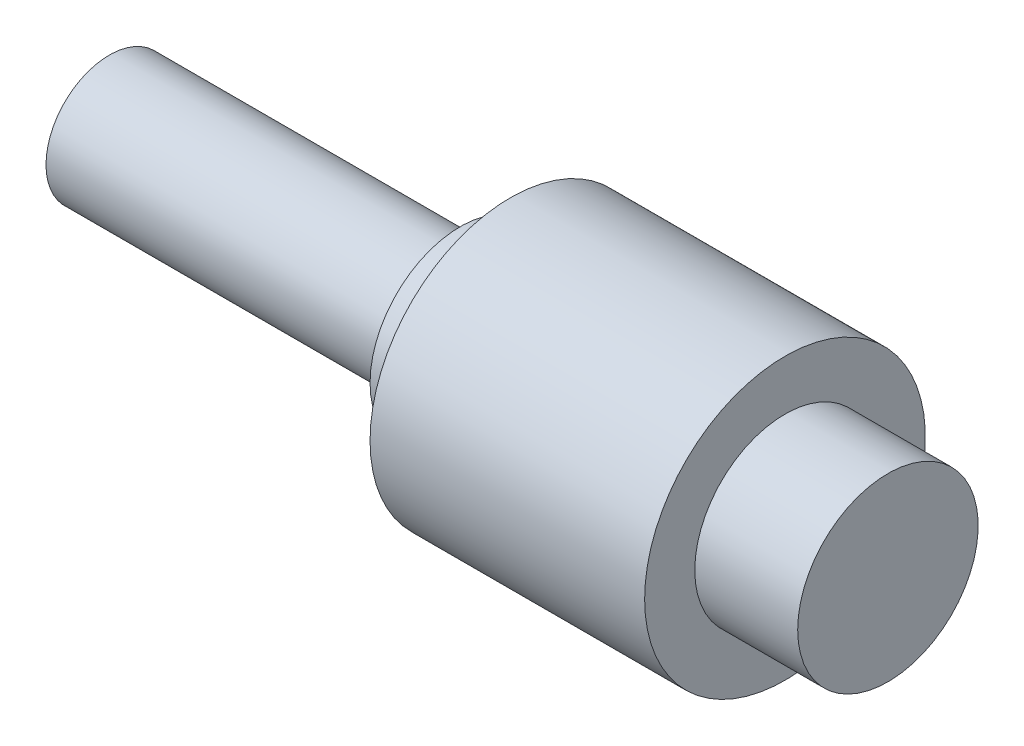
from build123d import *


with BuildPart() as part:
    # Sketch3 → Revolve1 (revolve)
    with BuildSketch(Plane.XY, mode=Mode.PRIVATE) as revolve1_sk:
        Polygon((29.734018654, 9), (40, 9), (40, 0), (-37.651766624, 0), (-37.651766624, 6.319177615), (-2.651766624, 6.319177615), (-2.651766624, 9), (2.348233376, 9), (2.348233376, 14), (29.734018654, 14), align=None)
    revolve(revolve1_sk.sketch.rotate(Axis((-37.651766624, 0, 0), (1, 0, 0)), 90), axis=Axis((-37.651766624, 0, 0), (1, 0, 0)))


solid = part.part
